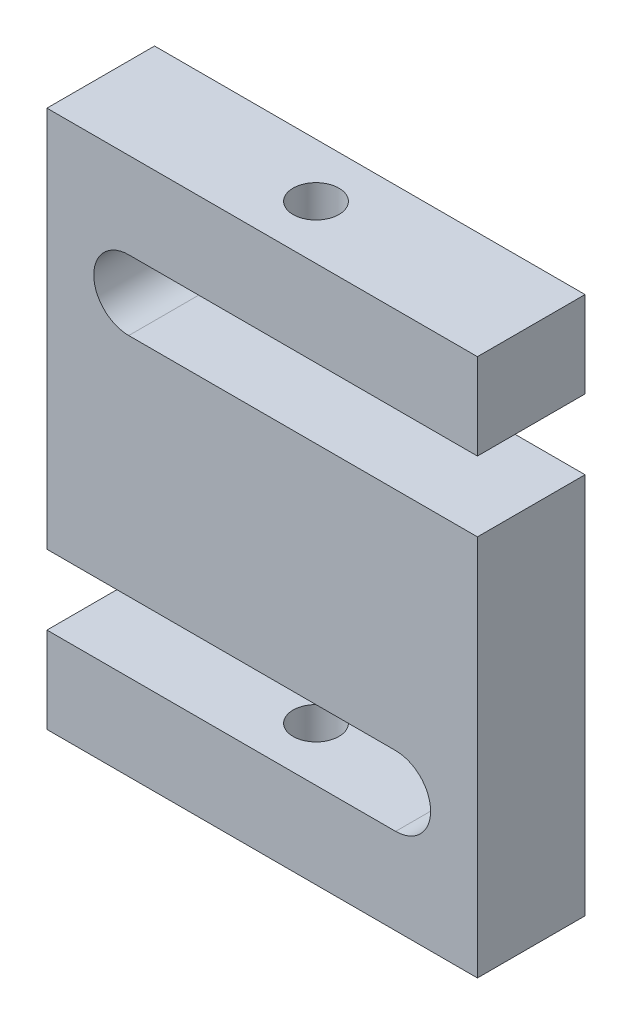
from build123d import *

# Parameters (mm, degrees)
EXTRUDE1_DEPTH               = 6.35
F_1_4_28_TAPPED_HOLE1_REACH  = 70.686
F_1_4_28_TAPPED_HOLE1_BORE_R = 2.7051


with BuildPart() as part:
    # Sketch1 → Extrude1 (new, symmetric)
    with BuildSketch(Plane.XY):
        with BuildLine():
            Line((-25.4, -31.75), (25.4, -31.75))
            Line((25.4, -31.75), (25.4, 13.335))
            Line((25.4, 13.335), (-15.748, 13.335))
            ThreePointArc((-15.748, 13.335), (-19.8755, 17.4625), (-15.748, 21.59))
            Line((-15.748, 21.59), (25.4, 21.59))
            Line((25.4, 21.59), (25.4, 31.75))
            Line((25.4, 31.75), (-25.4, 31.75))
            Line((-25.4, 31.75), (-25.4, -13.335))
            Line((-25.4, -13.335), (15.748, -13.335))
            ThreePointArc((15.748, -13.335), (19.8755, -17.4625), (15.748, -21.59))
            Line((15.748, -21.59), (-25.4, -21.59))
            Line((-25.4, -21.59), (-25.4, -31.75))
        make_face()
    extrude(amount=EXTRUDE1_DEPTH, both=True)

    # 1_4-28 Tapped Hole1 bore (on position points) → 1_4-28 Tapped Hole1 (cut, up to next)
    with BuildSketch(Plane.ZX.offset(31.75), mode=Mode.PRIVATE) as f_1_4_28_tapped_hole1_sk1:
        Circle(F_1_4_28_TAPPED_HOLE1_BORE_R)
    f_1_4_28_tapped_hole1_tool1 = extrude(f_1_4_28_tapped_hole1_sk1.sketch, amount=-F_1_4_28_TAPPED_HOLE1_REACH, mode=Mode.PRIVATE) & part.part
    f_1_4_28_tapped_hole1 = f_1_4_28_tapped_hole1_tool1.solids().sort_by_distance((0, 31.75, 0))[0]
    add(f_1_4_28_tapped_hole1, mode=Mode.SUBTRACT)

    # Mirror1: 1_4-28 Tapped Hole1 across plane
    add(f_1_4_28_tapped_hole1.mirror(Plane.ZX), mode=Mode.SUBTRACT)


solid = part.part
